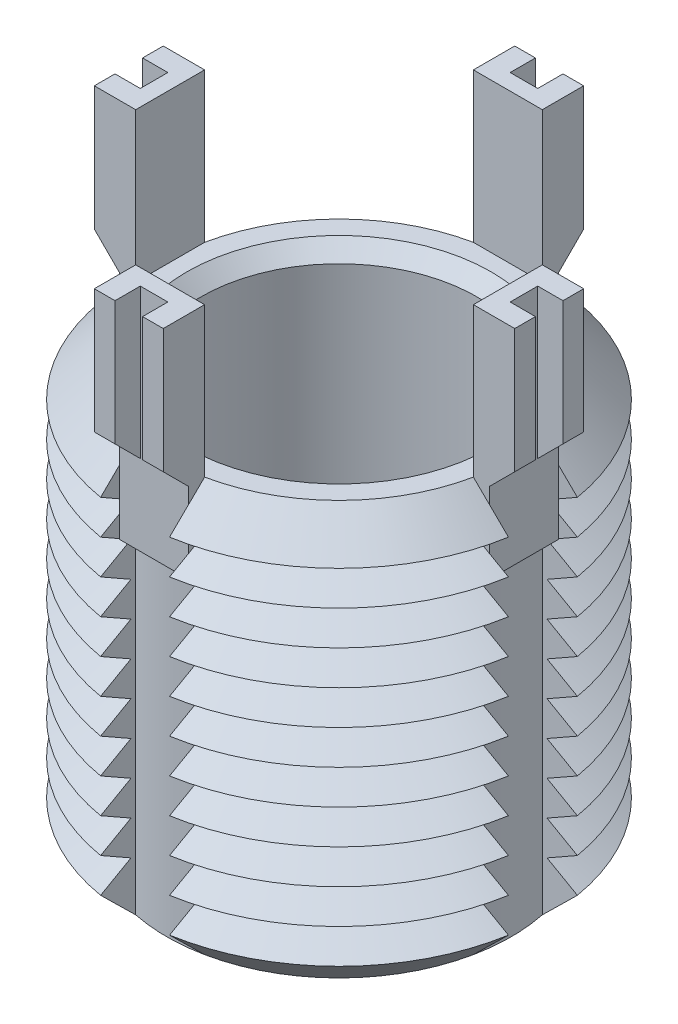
from build123d import *

# Parameters (mm, degrees)
SKETCH1_R               = 9
BOSS_EXTRUDE1_DEPTH     = 18
CHAMFER1_SIZE           = 1.5
LPATTERN1_COUNT         = 10
LPATTERN1_PITCH         = 1.5
CUT_EXTRUDE1_REACH      = 24.045
CIRPATTERN1_COUNT       = 4
BOSS_EXTRUDE3_DEPTH     = 1.5
CIRPATTERN2_COUNT       = 4
CUT_EXTRUDE3_DEPTH      = 28.706298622
CUT_EXTRUDE3_DEPTH_BACK = 28.706298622
SKETCH6_W               = 1.1
SKETCH6_H               = 1.2
SKETCH6_W_2             = 1.2
SKETCH6_H_2             = 1.1
SKETCH7_R               = 6
CUT_EXTRUDE4_DEPTH      = 18
CHAMFER2_SIZE           = 0.625


with BuildPart() as part:
    # Sketch1 → Boss-Extrude1 (new body)
    with BuildSketch(Plane(origin=(0, 0, 0), x_dir=(1, 0, 0), z_dir=(0, 1, 0))):
        with Locations(Location((0, 0, 0), (0, 0, 270))):
            Circle(SKETCH1_R)
    extrude(amount=-BOSS_EXTRUDE1_DEPTH)

    # Chamfer1
    chamfer1_edges = [part.edges().sort_by_distance(p)[0] for p in [
        (0, 0, -9),
        (0, -18, -9),
    ]]
    chamfer(chamfer1_edges, length=CHAMFER1_SIZE)

    # Sketch3 → Cut-Revolve1 (revolve, cut)
    with BuildSketch(Plane(origin=(0, 0, 0), x_dir=(0, 0, -1), z_dir=(1, 0, 0))):
        Polygon((-9, -1.5), (-7.700961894, -2.25), (-9, -3), align=None)
    cut_revolve1 = revolve(axis=Axis((0, 0.885892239, 0), (0, -1, 0)), mode=Mode.SUBTRACT)

    # LPattern1: Cut-Revolve1 ×10
    with Locations(*[(0, -i * LPATTERN1_PITCH, 0) for i in range(1, LPATTERN1_COUNT)]):
        add(cut_revolve1, mode=Mode.SUBTRACT)

    # Cut-Extrude1: up to this cone (the profile starts inside it)
    cut_extrude1_end = Plane(origin=(0, 0, 0), z_dir=(0, 1, 0)).offset(-25.499999) * Cone(1e-06, 75.545, 75.544999, align=(Align.CENTER, Align.CENTER, Align.MIN), mode=Mode.PRIVATE)
    # Sketch4 → Cut-Extrude1 (cut, up to the surface)
    with BuildSketch(Plane(origin=(0, 0, 0), x_dir=(1, 0, 0), z_dir=(0, 1, 0)), mode=Mode.PRIVATE) as cut_extrude1_sk1:
        with BuildLine():
            Line((-7.348469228, 1.5), (-8.874119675, 1.5))
            ThreePointArc((-8.874119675, 1.5), (-9, 0), (-8.874119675, -1.5))
            Line((-8.874119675, -1.5), (-7.348469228, -1.5))
            ThreePointArc((-7.348469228, -1.5), (-7.5, 0), (-7.348469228, 1.5))
        make_face()
    cut_extrude1_tool1 = extrude(cut_extrude1_sk1.sketch, amount=-CUT_EXTRUDE1_REACH, mode=Mode.PRIVATE) & cut_extrude1_end
    cut_extrude1 = cut_extrude1_tool1.solids().sort_by_distance((-8.203718, 0, 0))[0]
    add(cut_extrude1, mode=Mode.SUBTRACT)

    # CirPattern1: Cut-Extrude1 ×4 about axis
    cirpattern1_axis = Axis((0, 0, 0), (0, 1, 0))
    for i in range(1, CIRPATTERN1_COUNT):
        add(cut_extrude1.rotate(cirpattern1_axis, i * 360 / CIRPATTERN1_COUNT), mode=Mode.SUBTRACT)

    # Sketch5 → Boss-Extrude3 (add, symmetric)
    with BuildSketch(Plane(origin=(0, 0, 0), x_dir=(0, 0, -1), z_dir=(1, 0, 0))):
        Polygon((-7.348469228, 6.5), (-7.348469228, -3.5), (-8.048469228, -3.5), (-8.048469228, 0), (-9.148469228, 1.1), (-9.148469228, 6.5), align=None)
    boss_extrude3 = extrude(amount=BOSS_EXTRUDE3_DEPTH, both=True)

    # CirPattern2: Boss-Extrude3 ×4 about axis
    cirpattern2_axis = Axis((0, 0, 0), (0, 1, 0))
    for i in range(1, CIRPATTERN2_COUNT):
        add(boss_extrude3.rotate(cirpattern2_axis, i * 360 / CIRPATTERN2_COUNT))

    # Sketch6 → Cut-Extrude3 (cut, two sides: drawn at the far end of the back side and taken through both)
    with BuildSketch(Plane(origin=(0, 6.5, 0), x_dir=(1, 0, 0), z_dir=(0, 1, 0)).offset(-CUT_EXTRUDE3_DEPTH_BACK)):
        with Locations((-8.598469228, 0)):
            Rectangle(SKETCH6_W, SKETCH6_H)
        with Locations((0, 8.598469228)):
            Rectangle(SKETCH6_W_2, SKETCH6_H_2)
        with Locations((8.598469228, 0)):
            Rectangle(SKETCH6_W, SKETCH6_H)
        with Locations((0, -8.598469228)):
            Rectangle(SKETCH6_W_2, SKETCH6_H_2)
    extrude(amount=CUT_EXTRUDE3_DEPTH + CUT_EXTRUDE3_DEPTH_BACK, mode=Mode.SUBTRACT)

    # Sketch7 → Cut-Extrude4 (cut)
    with BuildSketch(Plane(origin=(0, 0, 0), x_dir=(1, 0, 0), z_dir=(0, 1, 0))):
        with Locations(Location((0, 0, 0), (0, 0, 270))):
            Circle(SKETCH7_R)
    extrude(amount=-CUT_EXTRUDE4_DEPTH, mode=Mode.SUBTRACT)

    # Chamfer2
    chamfer2_edges = [part.edges().sort_by_distance(p)[0] for p in [
        (0, 0, -6),
        (0, -18, -6),
    ]]
    chamfer(chamfer2_edges, length=CHAMFER2_SIZE)


solid = part.part
